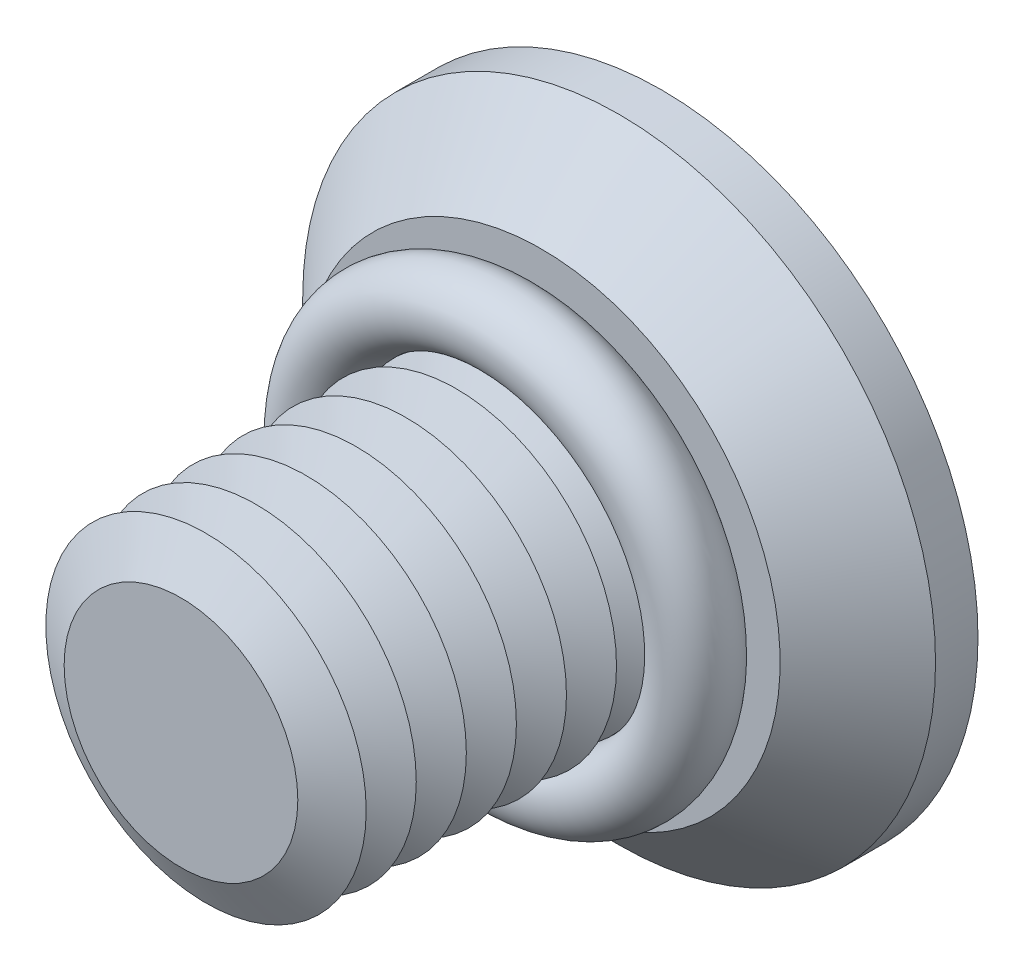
ISO-10303-21;
HEADER;
FILE_DESCRIPTION(('STEP AP214'),'2;1');
FILE_NAME('part.step','',(''),(''),'','','');
FILE_SCHEMA(('AUTOMOTIVE_DESIGN { 1 0 10303 214 1 1 1 1 }'));
ENDSEC;
DATA;
#1=APPLICATION_CONTEXT('core data for automotive mechanical design processes');
#2=APPLICATION_PROTOCOL_DEFINITION('international standard','automotive_design',2000,#1);
#3=PRODUCT_CONTEXT('',#1,'mechanical');
#4=PRODUCT('Part','Part','',(#3));
#5=PRODUCT_RELATED_PRODUCT_CATEGORY('part','',(#4));
#6=PRODUCT_DEFINITION_FORMATION('','',#4);
#7=PRODUCT_DEFINITION_CONTEXT('part definition',#1,'design');
#8=PRODUCT_DEFINITION('design','',#6,#7);
#9=PRODUCT_DEFINITION_SHAPE('','',#8);
#10=(LENGTH_UNIT() NAMED_UNIT(*) SI_UNIT(.MILLI.,.METRE.));
#11=(NAMED_UNIT(*) PLANE_ANGLE_UNIT() SI_UNIT($,.RADIAN.));
#12=(NAMED_UNIT(*) SI_UNIT($,.STERADIAN.) SOLID_ANGLE_UNIT());
#13=UNCERTAINTY_MEASURE_WITH_UNIT(LENGTH_MEASURE(1.E-05),#10,'distance_accuracy_value','');
#14=(GEOMETRIC_REPRESENTATION_CONTEXT(3) GLOBAL_UNCERTAINTY_ASSIGNED_CONTEXT((#13)) GLOBAL_UNIT_ASSIGNED_CONTEXT((#10,
#11,#12)) REPRESENTATION_CONTEXT('',''));
#15=CARTESIAN_POINT('',(0.,0.,0.));
#16=DIRECTION('',(0.,0.,1.));
#17=DIRECTION('',(1.,0.,0.));
#18=AXIS2_PLACEMENT_3D('',#15,#16,#17);
#19=CARTESIAN_POINT('',(0.,0.,3.9));
#20=DIRECTION('',(0.,0.,1.));
#21=DIRECTION('',(1.,0.,0.));
#22=AXIS2_PLACEMENT_3D('',#19,#20,#21);
#23=TOROIDAL_SURFACE('',#22,4.75,0.9);
#24=CARTESIAN_POINT('',(0.,4.75,3.9));
#25=DIRECTION('',(1.,0.,0.));
#26=DIRECTION('',(0.,0.,-1.));
#27=AXIS2_PLACEMENT_3D('',#24,#25,#26);
#28=CIRCLE('',#27,0.9);
#29=CARTESIAN_POINT('',(0.,5.65,3.9));
#30=VERTEX_POINT('',#29);
#31=EDGE_CURVE('P0_E10',#30,#30,#28,.T.);
#32=CARTESIAN_POINT('',(0.,0.,3.9));
#33=DIRECTION('',(0.,0.,1.));
#34=DIRECTION('',(1.,0.,0.));
#35=AXIS2_PLACEMENT_3D('',#32,#33,#34);
#36=CIRCLE('',#35,5.65);
#37=EDGE_CURVE('',#30,#30,#36,.T.);
#38=ORIENTED_EDGE('',*,*,#31,.F.);
#39=ORIENTED_EDGE('',*,*,#31,.T.);
#40=ORIENTED_EDGE('',*,*,#37,.T.);
#41=ORIENTED_EDGE('',*,*,#37,.F.);
#42=EDGE_LOOP('',(#38,#40,#39,#41));
#43=FACE_BOUND('',#42,.T.);
#44=ADVANCED_FACE('P0_F14',(#43),#23,.T.);
#45=CLOSED_SHELL('',(#44));
#46=MANIFOLD_SOLID_BREP('P0_B1',#45);
#47=CARTESIAN_POINT('',(0.,0.,5.75));
#48=DIRECTION('',(0.,0.,-1.));
#49=DIRECTION('',(-1.,0.,0.));
#50=AXIS2_PLACEMENT_3D('',#47,#48,#49);
#51=CONICAL_SURFACE('',#50,2.91746824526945,1.0471975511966);
#52=CARTESIAN_POINT('',(0.,0.,5.125));
#53=DIRECTION('',(0.,0.,1.));
#54=DIRECTION('',(1.,0.,0.));
#55=AXIS2_PLACEMENT_3D('',#52,#53,#54);
#56=CIRCLE('',#55,4.);
#57=CARTESIAN_POINT('',(4.,0.,5.125));
#58=VERTEX_POINT('',#57);
#59=EDGE_CURVE('P1_E324',#58,#58,#56,.T.);
#60=ORIENTED_EDGE('',*,*,#59,.T.);
#61=EDGE_LOOP('',(#60));
#62=FACE_BOUND('',#61,.T.);
#63=CARTESIAN_POINT('',(0.,0.,5.75));
#64=DIRECTION('',(0.,0.,1.));
#65=DIRECTION('',(1.,0.,0.));
#66=AXIS2_PLACEMENT_3D('',#63,#64,#65);
#67=CIRCLE('',#66,2.91746824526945);
#68=CARTESIAN_POINT('',(2.91746824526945,0.,5.75));
#69=VERTEX_POINT('',#68);
#70=EDGE_CURVE('P1_E321',#69,#69,#67,.T.);
#71=ORIENTED_EDGE('',*,*,#70,.F.);
#72=EDGE_LOOP('',(#71));
#73=FACE_BOUND('',#72,.T.);
#74=ADVANCED_FACE('P1_F15',(#62,#73),#51,.T.);
#75=CARTESIAN_POINT('',(0.,0.,6.375));
#76=DIRECTION('',(0.,0.,1.));
#77=DIRECTION('',(1.,0.,0.));
#78=AXIS2_PLACEMENT_3D('',#75,#76,#77);
#79=CONICAL_SURFACE('',#78,4.,1.0471975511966);
#80=ORIENTED_EDGE('',*,*,#70,.T.);
#81=EDGE_LOOP('',(#80));
#82=FACE_BOUND('',#81,.T.);
#83=CARTESIAN_POINT('',(0.,0.,6.375));
#84=DIRECTION('',(0.,0.,1.));
#85=DIRECTION('',(1.,0.,0.));
#86=AXIS2_PLACEMENT_3D('',#83,#84,#85);
#87=CIRCLE('',#86,4.);
#88=CARTESIAN_POINT('',(4.,0.,6.375));
#89=VERTEX_POINT('',#88);
#90=EDGE_CURVE('P1_E318',#89,#89,#87,.T.);
#91=ORIENTED_EDGE('',*,*,#90,.F.);
#92=EDGE_LOOP('',(#91));
#93=FACE_BOUND('',#92,.T.);
#94=ADVANCED_FACE('P1_F245',(#82,#93),#79,.T.);
#95=CARTESIAN_POINT('',(0.,0.,12.));
#96=DIRECTION('',(0.,0.,1.));
#97=DIRECTION('',(1.,0.,0.));
#98=AXIS2_PLACEMENT_3D('',#95,#96,#97);
#99=PLANE('',#98);
#100=CARTESIAN_POINT('',(0.,0.,12.));
#101=DIRECTION('',(0.,0.,1.));
#102=DIRECTION('',(1.,0.,0.));
#103=AXIS2_PLACEMENT_3D('',#100,#101,#102);
#104=CIRCLE('',#103,2.91746824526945);
#105=CARTESIAN_POINT('',(2.91746824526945,0.,12.));
#106=VERTEX_POINT('',#105);
#107=EDGE_CURVE('P1_E131',#106,#106,#104,.T.);
#108=ORIENTED_EDGE('',*,*,#107,.T.);
#109=EDGE_LOOP('',(#108));
#110=FACE_BOUND('',#109,.T.);
#111=ADVANCED_FACE('P1_F251',(#110),#99,.T.);
#112=CARTESIAN_POINT('',(0.,0.,12.));
#113=DIRECTION('',(0.,0.,-1.));
#114=DIRECTION('',(-1.,0.,0.));
#115=AXIS2_PLACEMENT_3D('',#112,#113,#114);
#116=CONICAL_SURFACE('',#115,2.91746824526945,1.0471975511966);
#117=CARTESIAN_POINT('',(0.,0.,11.375));
#118=DIRECTION('',(0.,0.,1.));
#119=DIRECTION('',(1.,0.,0.));
#120=AXIS2_PLACEMENT_3D('',#117,#118,#119);
#121=CIRCLE('',#120,4.);
#122=CARTESIAN_POINT('',(4.,0.,11.375));
#123=VERTEX_POINT('',#122);
#124=EDGE_CURVE('P1_E133',#123,#123,#121,.T.);
#125=ORIENTED_EDGE('',*,*,#124,.T.);
#126=EDGE_LOOP('',(#125));
#127=FACE_BOUND('',#126,.T.);
#128=ORIENTED_EDGE('',*,*,#107,.F.);
#129=EDGE_LOOP('',(#128));
#130=FACE_BOUND('',#129,.T.);
#131=ADVANCED_FACE('P1_F196',(#127,#130),#116,.T.);
#132=CARTESIAN_POINT('',(0.,0.,11.375));
#133=DIRECTION('',(0.,0.,1.));
#134=DIRECTION('',(1.,0.,0.));
#135=AXIS2_PLACEMENT_3D('',#132,#133,#134);
#136=CONICAL_SURFACE('',#135,4.,1.0471975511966);
#137=CARTESIAN_POINT('',(0.,0.,10.75));
#138=DIRECTION('',(0.,0.,1.));
#139=DIRECTION('',(1.,0.,0.));
#140=AXIS2_PLACEMENT_3D('',#137,#138,#139);
#141=CIRCLE('',#140,2.91746824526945);
#142=CARTESIAN_POINT('',(2.91746824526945,0.,10.75));
#143=VERTEX_POINT('',#142);
#144=EDGE_CURVE('P1_E297',#143,#143,#141,.T.);
#145=ORIENTED_EDGE('',*,*,#144,.T.);
#146=EDGE_LOOP('',(#145));
#147=FACE_BOUND('',#146,.T.);
#148=ORIENTED_EDGE('',*,*,#124,.F.);
#149=EDGE_LOOP('',(#148));
#150=FACE_BOUND('',#149,.T.);
#151=ADVANCED_FACE('P1_F284',(#147,#150),#136,.T.);
#152=CARTESIAN_POINT('',(0.,0.,10.75));
#153=DIRECTION('',(0.,0.,-1.));
#154=DIRECTION('',(-1.,0.,0.));
#155=AXIS2_PLACEMENT_3D('',#152,#153,#154);
#156=CONICAL_SURFACE('',#155,2.91746824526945,1.0471975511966);
#157=CARTESIAN_POINT('',(0.,0.,10.125));
#158=DIRECTION('',(0.,0.,1.));
#159=DIRECTION('',(1.,0.,0.));
#160=AXIS2_PLACEMENT_3D('',#157,#158,#159);
#161=CIRCLE('',#160,4.);
#162=CARTESIAN_POINT('',(4.,0.,10.125));
#163=VERTEX_POINT('',#162);
#164=EDGE_CURVE('P1_E294',#163,#163,#161,.T.);
#165=ORIENTED_EDGE('',*,*,#164,.T.);
#166=EDGE_LOOP('',(#165));
#167=FACE_BOUND('',#166,.T.);
#168=ORIENTED_EDGE('',*,*,#144,.F.);
#169=EDGE_LOOP('',(#168));
#170=FACE_BOUND('',#169,.T.);
#171=ADVANCED_FACE('P1_F279',(#167,#170),#156,.T.);
#172=CARTESIAN_POINT('',(0.,0.,10.125));
#173=DIRECTION('',(0.,0.,1.));
#174=DIRECTION('',(1.,0.,0.));
#175=AXIS2_PLACEMENT_3D('',#172,#173,#174);
#176=CONICAL_SURFACE('',#175,4.,1.0471975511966);
#177=CARTESIAN_POINT('',(0.,0.,9.5));
#178=DIRECTION('',(0.,0.,1.));
#179=DIRECTION('',(1.,0.,0.));
#180=AXIS2_PLACEMENT_3D('',#177,#178,#179);
#181=CIRCLE('',#180,2.91746824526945);
#182=CARTESIAN_POINT('',(2.91746824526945,0.,9.5));
#183=VERTEX_POINT('',#182);
#184=EDGE_CURVE('P1_E301',#183,#183,#181,.T.);
#185=ORIENTED_EDGE('',*,*,#184,.T.);
#186=EDGE_LOOP('',(#185));
#187=FACE_BOUND('',#186,.T.);
#188=ORIENTED_EDGE('',*,*,#164,.F.);
#189=EDGE_LOOP('',(#188));
#190=FACE_BOUND('',#189,.T.);
#191=ADVANCED_FACE('P1_F276',(#187,#190),#176,.T.);
#192=CARTESIAN_POINT('',(0.,0.,9.5));
#193=DIRECTION('',(0.,0.,-1.));
#194=DIRECTION('',(-1.,0.,0.));
#195=AXIS2_PLACEMENT_3D('',#192,#193,#194);
#196=CONICAL_SURFACE('',#195,2.91746824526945,1.0471975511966);
#197=CARTESIAN_POINT('',(0.,0.,8.875));
#198=DIRECTION('',(0.,0.,1.));
#199=DIRECTION('',(1.,0.,0.));
#200=AXIS2_PLACEMENT_3D('',#197,#198,#199);
#201=CIRCLE('',#200,4.);
#202=CARTESIAN_POINT('',(4.,0.,8.875));
#203=VERTEX_POINT('',#202);
#204=EDGE_CURVE('P1_E306',#203,#203,#201,.T.);
#205=ORIENTED_EDGE('',*,*,#204,.T.);
#206=EDGE_LOOP('',(#205));
#207=FACE_BOUND('',#206,.T.);
#208=ORIENTED_EDGE('',*,*,#184,.F.);
#209=EDGE_LOOP('',(#208));
#210=FACE_BOUND('',#209,.T.);
#211=ADVANCED_FACE('P1_F271',(#207,#210),#196,.T.);
#212=CARTESIAN_POINT('',(0.,0.,8.875));
#213=DIRECTION('',(0.,0.,1.));
#214=DIRECTION('',(1.,0.,0.));
#215=AXIS2_PLACEMENT_3D('',#212,#213,#214);
#216=CONICAL_SURFACE('',#215,4.,1.0471975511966);
#217=CARTESIAN_POINT('',(0.,0.,8.25));
#218=DIRECTION('',(0.,0.,1.));
#219=DIRECTION('',(1.,0.,0.));
#220=AXIS2_PLACEMENT_3D('',#217,#218,#219);
#221=CIRCLE('',#220,2.91746824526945);
#222=CARTESIAN_POINT('',(2.91746824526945,0.,8.25));
#223=VERTEX_POINT('',#222);
#224=EDGE_CURVE('P1_E309',#223,#223,#221,.T.);
#225=ORIENTED_EDGE('',*,*,#224,.T.);
#226=EDGE_LOOP('',(#225));
#227=FACE_BOUND('',#226,.T.);
#228=ORIENTED_EDGE('',*,*,#204,.F.);
#229=EDGE_LOOP('',(#228));
#230=FACE_BOUND('',#229,.T.);
#231=ADVANCED_FACE('P1_F268',(#227,#230),#216,.T.);
#232=CARTESIAN_POINT('',(0.,0.,8.25));
#233=DIRECTION('',(0.,0.,-1.));
#234=DIRECTION('',(-1.,0.,0.));
#235=AXIS2_PLACEMENT_3D('',#232,#233,#234);
#236=CONICAL_SURFACE('',#235,2.91746824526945,1.0471975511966);
#237=CARTESIAN_POINT('',(0.,0.,7.625));
#238=DIRECTION('',(0.,0.,1.));
#239=DIRECTION('',(1.,0.,0.));
#240=AXIS2_PLACEMENT_3D('',#237,#238,#239);
#241=CIRCLE('',#240,4.);
#242=CARTESIAN_POINT('',(4.,0.,7.625));
#243=VERTEX_POINT('',#242);
#244=EDGE_CURVE('P1_E312',#243,#243,#241,.T.);
#245=ORIENTED_EDGE('',*,*,#244,.T.);
#246=EDGE_LOOP('',(#245));
#247=FACE_BOUND('',#246,.T.);
#248=ORIENTED_EDGE('',*,*,#224,.F.);
#249=EDGE_LOOP('',(#248));
#250=FACE_BOUND('',#249,.T.);
#251=ADVANCED_FACE('P1_F262',(#247,#250),#236,.T.);
#252=CARTESIAN_POINT('',(0.,0.,7.625));
#253=DIRECTION('',(0.,0.,1.));
#254=DIRECTION('',(1.,0.,0.));
#255=AXIS2_PLACEMENT_3D('',#252,#253,#254);
#256=CONICAL_SURFACE('',#255,4.,1.0471975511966);
#257=CARTESIAN_POINT('',(0.,0.,7.));
#258=DIRECTION('',(0.,0.,1.));
#259=DIRECTION('',(1.,0.,0.));
#260=AXIS2_PLACEMENT_3D('',#257,#258,#259);
#261=CIRCLE('',#260,2.91746824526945);
#262=CARTESIAN_POINT('',(2.91746824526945,0.,7.));
#263=VERTEX_POINT('',#262);
#264=EDGE_CURVE('P1_E315',#263,#263,#261,.T.);
#265=ORIENTED_EDGE('',*,*,#264,.T.);
#266=EDGE_LOOP('',(#265));
#267=FACE_BOUND('',#266,.T.);
#268=ORIENTED_EDGE('',*,*,#244,.F.);
#269=EDGE_LOOP('',(#268));
#270=FACE_BOUND('',#269,.T.);
#271=ADVANCED_FACE('P1_F258',(#267,#270),#256,.T.);
#272=CARTESIAN_POINT('',(0.,0.,7.));
#273=DIRECTION('',(0.,0.,-1.));
#274=DIRECTION('',(-1.,0.,0.));
#275=AXIS2_PLACEMENT_3D('',#272,#273,#274);
#276=CONICAL_SURFACE('',#275,2.91746824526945,1.0471975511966);
#277=ORIENTED_EDGE('',*,*,#90,.T.);
#278=EDGE_LOOP('',(#277));
#279=FACE_BOUND('',#278,.T.);
#280=ORIENTED_EDGE('',*,*,#264,.F.);
#281=EDGE_LOOP('',(#280));
#282=FACE_BOUND('',#281,.T.);
#283=ADVANCED_FACE('P1_F261',(#279,#282),#276,.T.);
#284=CARTESIAN_POINT('',(0.,0.,4.5));
#285=DIRECTION('',(0.,0.,-1.));
#286=DIRECTION('',(-1.,0.,0.));
#287=AXIS2_PLACEMENT_3D('',#284,#285,#286);
#288=CONICAL_SURFACE('',#287,2.91746824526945,1.0471975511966);
#289=CARTESIAN_POINT('',(0.,0.,4.5));
#290=DIRECTION('',(0.,0.,1.));
#291=DIRECTION('',(1.,0.,0.));
#292=AXIS2_PLACEMENT_3D('',#289,#290,#291);
#293=CIRCLE('',#292,2.91746824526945);
#294=CARTESIAN_POINT('',(2.91746824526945,0.,4.5));
#295=VERTEX_POINT('',#294);
#296=EDGE_CURVE('P1_E326',#295,#295,#293,.T.);
#297=ORIENTED_EDGE('',*,*,#296,.F.);
#298=EDGE_LOOP('',(#297));
#299=FACE_BOUND('',#298,.T.);
#300=CARTESIAN_POINT('',(0.,0.,3.96160254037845));
#301=DIRECTION('',(0.,0.,-1.));
#302=DIRECTION('',(-1.,0.,0.));
#303=AXIS2_PLACEMENT_3D('',#300,#301,#302);
#304=CIRCLE('',#303,3.85);
#305=CARTESIAN_POINT('',(-3.85,0.,3.96160254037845));
#306=VERTEX_POINT('',#305);
#307=EDGE_CURVE('P1_E19',#306,#306,#304,.F.);
#308=ORIENTED_EDGE('',*,*,#307,.T.);
#309=EDGE_LOOP('',(#308));
#310=FACE_BOUND('',#309,.T.);
#311=ADVANCED_FACE('P1_F266',(#299,#310),#288,.T.);
#312=CARTESIAN_POINT('',(0.,0.,5.125));
#313=DIRECTION('',(0.,0.,1.));
#314=DIRECTION('',(1.,0.,0.));
#315=AXIS2_PLACEMENT_3D('',#312,#313,#314);
#316=CONICAL_SURFACE('',#315,4.,1.0471975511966);
#317=ORIENTED_EDGE('',*,*,#296,.T.);
#318=EDGE_LOOP('',(#317));
#319=FACE_BOUND('',#318,.T.);
#320=ORIENTED_EDGE('',*,*,#59,.F.);
#321=EDGE_LOOP('',(#320));
#322=FACE_BOUND('',#321,.T.);
#323=ADVANCED_FACE('P1_F330',(#319,#322),#316,.T.);
#324=CARTESIAN_POINT('',(0.,0.,3.));
#325=DIRECTION('',(0.,0.,-1.));
#326=DIRECTION('',(-1.,0.,0.));
#327=AXIS2_PLACEMENT_3D('',#324,#325,#326);
#328=CONICAL_SURFACE('',#327,2.5,1.0471975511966);
#329=CARTESIAN_POINT('',(0.,0.,4.44337567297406));
#330=VERTEX_POINT('',#329);
#331=VERTEX_LOOP('',#330);
#332=FACE_BOUND('',#331,.T.);
#333=CARTESIAN_POINT('',(0.,0.,3.));
#334=DIRECTION('',(0.,0.,-1.));
#335=DIRECTION('',(-1.,0.,0.));
#336=AXIS2_PLACEMENT_3D('',#333,#334,#335);
#337=CIRCLE('',#336,2.5);
#338=CARTESIAN_POINT('',(-2.5,0.,3.));
#339=VERTEX_POINT('',#338);
#340=CARTESIAN_POINT('',(-1.25,2.1650635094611,3.));
#341=VERTEX_POINT('',#340);
#342=EDGE_CURVE('P1_E117',#339,#341,#337,.T.);
#343=ORIENTED_EDGE('',*,*,#342,.T.);
#344=CARTESIAN_POINT('',(0.,0.,3.));
#345=DIRECTION('',(0.,0.,-1.));
#346=DIRECTION('',(-1.,0.,0.));
#347=AXIS2_PLACEMENT_3D('',#344,#345,#346);
#348=CIRCLE('',#347,2.5);
#349=CARTESIAN_POINT('',(1.25,2.1650635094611,3.));
#350=VERTEX_POINT('',#349);
#351=EDGE_CURVE('P1_E24',#341,#350,#348,.T.);
#352=ORIENTED_EDGE('',*,*,#351,.T.);
#353=CARTESIAN_POINT('',(2.5,0.,3.));
#354=VERTEX_POINT('',#353);
#355=EDGE_CURVE('P1_E635',#350,#354,#348,.T.);
#356=ORIENTED_EDGE('',*,*,#355,.T.);
#357=CARTESIAN_POINT('',(1.25,-2.1650635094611,3.));
#358=VERTEX_POINT('',#357);
#359=EDGE_CURVE('P1_E628',#354,#358,#348,.T.);
#360=ORIENTED_EDGE('',*,*,#359,.T.);
#361=CARTESIAN_POINT('',(-1.25,-2.1650635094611,3.));
#362=VERTEX_POINT('',#361);
#363=EDGE_CURVE('P1_E182',#358,#362,#348,.T.);
#364=ORIENTED_EDGE('',*,*,#363,.T.);
#365=EDGE_CURVE('P1_E179',#362,#339,#348,.T.);
#366=ORIENTED_EDGE('',*,*,#365,.T.);
#367=EDGE_LOOP('',(#343,#352,#356,#360,#364,#366));
#368=FACE_BOUND('',#367,.T.);
#369=ADVANCED_FACE('P1_F198',(#332,#368),#328,.F.);
#370=CARTESIAN_POINT('',(0.,0.,3.));
#371=DIRECTION('',(0.,0.,-1.));
#372=DIRECTION('',(-1.,0.,0.));
#373=AXIS2_PLACEMENT_3D('',#370,#371,#372);
#374=PLANE('',#373);
#375=ORIENTED_EDGE('',*,*,#363,.F.);
#376=DIRECTION('',(-0.866025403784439,-0.5,0.));
#377=VECTOR('',#376,1.);
#378=CARTESIAN_POINT('',(2.5,-1.44337567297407,3.));
#379=LINE('',#378,#377);
#380=CARTESIAN_POINT('',(0.,-2.88675134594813,3.));
#381=VERTEX_POINT('',#380);
#382=EDGE_CURVE('P1_E644',#358,#381,#379,.T.);
#383=ORIENTED_EDGE('',*,*,#382,.T.);
#384=DIRECTION('',(-0.866025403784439,0.5,0.));
#385=VECTOR('',#384,1.);
#386=CARTESIAN_POINT('',(0.,-2.88675134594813,3.));
#387=LINE('',#386,#385);
#388=EDGE_CURVE('P1_E651',#381,#362,#387,.T.);
#389=ORIENTED_EDGE('',*,*,#388,.T.);
#390=EDGE_LOOP('',(#375,#383,#389));
#391=FACE_BOUND('',#390,.T.);
#392=ADVANCED_FACE('P1_F442',(#391),#374,.T.);
#393=ORIENTED_EDGE('',*,*,#365,.F.);
#394=CARTESIAN_POINT('',(-2.5,-1.44337567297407,3.));
#395=VERTEX_POINT('',#394);
#396=EDGE_CURVE('P1_E654',#362,#395,#387,.T.);
#397=ORIENTED_EDGE('',*,*,#396,.T.);
#398=DIRECTION('',(0.,1.,0.));
#399=VECTOR('',#398,1.);
#400=CARTESIAN_POINT('',(-2.5,-1.44337567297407,3.));
#401=LINE('',#400,#399);
#402=EDGE_CURVE('P1_E123',#395,#339,#401,.T.);
#403=ORIENTED_EDGE('',*,*,#402,.T.);
#404=EDGE_LOOP('',(#393,#397,#403));
#405=FACE_BOUND('',#404,.T.);
#406=ADVANCED_FACE('P1_F231',(#405),#374,.T.);
#407=ORIENTED_EDGE('',*,*,#342,.F.);
#408=CARTESIAN_POINT('',(-2.5,1.44337567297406,3.));
#409=VERTEX_POINT('',#408);
#410=EDGE_CURVE('P1_E656',#339,#409,#401,.T.);
#411=ORIENTED_EDGE('',*,*,#410,.T.);
#412=DIRECTION('',(0.866025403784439,0.5,0.));
#413=VECTOR('',#412,1.);
#414=CARTESIAN_POINT('',(-2.5,1.44337567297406,3.));
#415=LINE('',#414,#413);
#416=EDGE_CURVE('P1_E659',#409,#341,#415,.T.);
#417=ORIENTED_EDGE('',*,*,#416,.T.);
#418=EDGE_LOOP('',(#407,#411,#417));
#419=FACE_BOUND('',#418,.T.);
#420=ADVANCED_FACE('P1_F459',(#419),#374,.T.);
#421=ORIENTED_EDGE('',*,*,#351,.F.);
#422=CARTESIAN_POINT('',(0.,2.88675134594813,3.));
#423=VERTEX_POINT('',#422);
#424=EDGE_CURVE('P1_E658',#341,#423,#415,.T.);
#425=ORIENTED_EDGE('',*,*,#424,.T.);
#426=DIRECTION('',(0.866025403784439,-0.5,0.));
#427=VECTOR('',#426,1.);
#428=CARTESIAN_POINT('',(0.,2.88675134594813,3.));
#429=LINE('',#428,#427);
#430=EDGE_CURVE('P1_E161',#423,#350,#429,.T.);
#431=ORIENTED_EDGE('',*,*,#430,.T.);
#432=EDGE_LOOP('',(#421,#425,#431));
#433=FACE_BOUND('',#432,.T.);
#434=ADVANCED_FACE('P1_F468',(#433),#374,.T.);
#435=ORIENTED_EDGE('',*,*,#355,.F.);
#436=CARTESIAN_POINT('',(2.5,1.44337567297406,3.));
#437=VERTEX_POINT('',#436);
#438=EDGE_CURVE('P1_E643',#350,#437,#429,.T.);
#439=ORIENTED_EDGE('',*,*,#438,.T.);
#440=DIRECTION('',(0.,-1.,0.));
#441=VECTOR('',#440,1.);
#442=CARTESIAN_POINT('',(2.5,1.44337567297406,3.));
#443=LINE('',#442,#441);
#444=EDGE_CURVE('P1_E638',#437,#354,#443,.T.);
#445=ORIENTED_EDGE('',*,*,#444,.T.);
#446=EDGE_LOOP('',(#435,#439,#445));
#447=FACE_BOUND('',#446,.T.);
#448=ADVANCED_FACE('P1_F477',(#447),#374,.T.);
#449=ORIENTED_EDGE('',*,*,#359,.F.);
#450=CARTESIAN_POINT('',(2.5,-1.44337567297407,3.));
#451=VERTEX_POINT('',#450);
#452=EDGE_CURVE('P1_E630',#354,#451,#443,.T.);
#453=ORIENTED_EDGE('',*,*,#452,.T.);
#454=EDGE_CURVE('P1_E125',#451,#358,#379,.T.);
#455=ORIENTED_EDGE('',*,*,#454,.T.);
#456=EDGE_LOOP('',(#449,#453,#455));
#457=FACE_BOUND('',#456,.T.);
#458=ADVANCED_FACE('P1_F229',(#457),#374,.T.);
#459=CARTESIAN_POINT('',(2.5,-1.44337567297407,3.));
#460=DIRECTION('',(0.5,-0.866025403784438,0.));
#461=DIRECTION('',(0.866025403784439,0.5,0.));
#462=AXIS2_PLACEMENT_3D('',#459,#460,#461);
#463=PLANE('',#462);
#464=DIRECTION('',(0.,0.,-1.));
#465=VECTOR('',#464,1.);
#466=CARTESIAN_POINT('',(2.5,-1.44337567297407,3.));
#467=LINE('',#466,#465);
#468=CARTESIAN_POINT('',(2.5,-1.44337567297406,0.));
#469=VERTEX_POINT('',#468);
#470=EDGE_CURVE('P1_E164',#451,#469,#467,.T.);
#471=ORIENTED_EDGE('',*,*,#470,.T.);
#472=CARTESIAN_POINT('',(2.5002,-1.44326020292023,-3.09419640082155E-05));
#473=CARTESIAN_POINT('',(2.3963647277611,-1.50320952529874,0.016040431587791));
#474=CARTESIAN_POINT('',(2.29234116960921,-1.56326755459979,0.0306306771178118));
#475=CARTESIAN_POINT('',(2.08392662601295,-1.68359574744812,0.0562644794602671));
#476=CARTESIAN_POINT('',(1.97953550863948,-1.74386598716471,0.0673065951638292));
#477=CARTESIAN_POINT('',(1.77101887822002,-1.86425311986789,0.0851994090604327));
#478=CARTESIAN_POINT('',(1.66689477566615,-1.9243691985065,0.0920714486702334));
#479=CARTESIAN_POINT('',(1.45851376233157,-2.04467803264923,0.101286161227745));
#480=CARTESIAN_POINT('',(1.35425688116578,-2.10487077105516,0.103629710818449));
#481=CARTESIAN_POINT('',(1.14574311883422,-2.22525624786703,0.103629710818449));
#482=CARTESIAN_POINT('',(1.04148623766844,-2.28544898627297,0.101286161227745));
#483=CARTESIAN_POINT('',(0.833105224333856,-2.4057578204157,0.0920714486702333));
#484=CARTESIAN_POINT('',(0.728981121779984,-2.4658738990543,0.0851994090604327));
#485=CARTESIAN_POINT('',(0.520464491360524,-2.58626103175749,0.0673065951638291));
#486=CARTESIAN_POINT('',(0.416073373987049,-2.64653127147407,0.056264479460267));
#487=CARTESIAN_POINT('',(0.207658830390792,-2.7668594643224,0.0306306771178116));
#488=CARTESIAN_POINT('',(0.103635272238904,-2.82691749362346,0.0160404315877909));
#489=CARTESIAN_POINT('',(-0.000199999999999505,-2.88686681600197,-3.09419640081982E-05));
#490=B_SPLINE_CURVE_WITH_KNOTS('',3,(#472,#473,#474,#475,#476,#477,#478,#479,#480,#481,#482,
#483,#484,#485,#486,#487,#488,#489),.UNSPECIFIED.,.F.,.F.,(4,2,2,2,2,2,2,2,4),(0.,
0.362931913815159,0.726011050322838,1.08721601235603,1.44835104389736,1.80948607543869,
2.17069103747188,2.53377017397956,2.89670208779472),.UNSPECIFIED.);
#491=CARTESIAN_POINT('',(0.,-2.88675134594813,0.));
#492=VERTEX_POINT('',#491);
#493=EDGE_CURVE('P1_E118',#469,#492,#490,.T.);
#494=ORIENTED_EDGE('',*,*,#493,.T.);
#495=DIRECTION('',(0.,0.,-1.));
#496=VECTOR('',#495,1.);
#497=CARTESIAN_POINT('',(0.,-2.88675134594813,3.));
#498=LINE('',#497,#496);
#499=EDGE_CURVE('P1_E116',#381,#492,#498,.T.);
#500=ORIENTED_EDGE('',*,*,#499,.F.);
#501=ORIENTED_EDGE('',*,*,#382,.F.);
#502=ORIENTED_EDGE('',*,*,#454,.F.);
#503=EDGE_LOOP('',(#471,#494,#500,#501,#502));
#504=FACE_BOUND('',#503,.T.);
#505=ADVANCED_FACE('P1_F226',(#504),#463,.F.);
#506=CARTESIAN_POINT('',(0.,-2.88675134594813,3.));
#507=DIRECTION('',(-0.5,-0.866025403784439,0.));
#508=DIRECTION('',(0.866025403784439,-0.5,0.));
#509=AXIS2_PLACEMENT_3D('',#506,#507,#508);
#510=PLANE('',#509);
#511=ORIENTED_EDGE('',*,*,#499,.T.);
#512=CARTESIAN_POINT('',(0.000200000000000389,-2.88686681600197,-3.09419640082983E-05));
#513=CARTESIAN_POINT('',(-0.103635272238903,-2.82691749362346,0.0160404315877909));
#514=CARTESIAN_POINT('',(-0.207658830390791,-2.7668594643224,0.0306306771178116));
#515=CARTESIAN_POINT('',(-0.416073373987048,-2.64653127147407,0.056264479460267));
#516=CARTESIAN_POINT('',(-0.520464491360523,-2.58626103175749,0.0673065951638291));
#517=CARTESIAN_POINT('',(-0.728981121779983,-2.4658738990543,0.0851994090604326));
#518=CARTESIAN_POINT('',(-0.833105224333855,-2.4057578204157,0.0920714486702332));
#519=CARTESIAN_POINT('',(-1.04148623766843,-2.28544898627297,0.101286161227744));
#520=CARTESIAN_POINT('',(-1.14574311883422,-2.22525624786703,0.103629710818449));
#521=CARTESIAN_POINT('',(-1.35425688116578,-2.10487077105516,0.103629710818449));
#522=CARTESIAN_POINT('',(-1.45851376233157,-2.04467803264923,0.101286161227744));
#523=CARTESIAN_POINT('',(-1.66689477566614,-1.9243691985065,0.0920714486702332));
#524=CARTESIAN_POINT('',(-1.77101887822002,-1.8642531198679,0.0851994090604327));
#525=CARTESIAN_POINT('',(-1.97953550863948,-1.74386598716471,0.0673065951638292));
#526=CARTESIAN_POINT('',(-2.08392662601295,-1.68359574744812,0.0562644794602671));
#527=CARTESIAN_POINT('',(-2.29234116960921,-1.56326755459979,0.0306306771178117));
#528=CARTESIAN_POINT('',(-2.3963647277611,-1.50320952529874,0.016040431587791));
#529=CARTESIAN_POINT('',(-2.5002,-1.44326020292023,-3.09419640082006E-05));
#530=B_SPLINE_CURVE_WITH_KNOTS('',3,(#512,#513,#514,#515,#516,#517,#518,#519,#520,#521,#522,
#523,#524,#525,#526,#527,#528,#529),.UNSPECIFIED.,.F.,.F.,(4,2,2,2,2,2,2,2,4),(0.,
0.362931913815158,0.726011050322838,1.08721601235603,1.44835104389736,1.80948607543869,
2.17069103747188,2.53377017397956,2.89670208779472),.UNSPECIFIED.);
#531=CARTESIAN_POINT('',(-2.5,-1.44337567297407,0.));
#532=VERTEX_POINT('',#531);
#533=EDGE_CURVE('P1_E94',#492,#532,#530,.T.);
#534=ORIENTED_EDGE('',*,*,#533,.T.);
#535=DIRECTION('',(0.,0.,-1.));
#536=VECTOR('',#535,1.);
#537=CARTESIAN_POINT('',(-2.5,-1.44337567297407,3.));
#538=LINE('',#537,#536);
#539=EDGE_CURVE('P1_E112',#395,#532,#538,.T.);
#540=ORIENTED_EDGE('',*,*,#539,.F.);
#541=ORIENTED_EDGE('',*,*,#396,.F.);
#542=ORIENTED_EDGE('',*,*,#388,.F.);
#543=EDGE_LOOP('',(#511,#534,#540,#541,#542));
#544=FACE_BOUND('',#543,.T.);
#545=ADVANCED_FACE('P1_F110',(#544),#510,.F.);
#546=CARTESIAN_POINT('',(-2.5,-1.44337567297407,3.));
#547=DIRECTION('',(-1.,0.,0.));
#548=DIRECTION('',(0.,-1.,0.));
#549=AXIS2_PLACEMENT_3D('',#546,#547,#548);
#550=PLANE('',#549);
#551=ORIENTED_EDGE('',*,*,#539,.T.);
#552=CARTESIAN_POINT('',(-2.5,-3.76800948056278,-0.438146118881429));
#553=CARTESIAN_POINT('',(-2.5,-3.65512241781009,-0.412947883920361));
#554=CARTESIAN_POINT('',(-2.5,-3.54216337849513,-0.38806689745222));
#555=CARTESIAN_POINT('',(-2.5,-3.31606595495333,-0.339109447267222));
#556=CARTESIAN_POINT('',(-2.5,-3.202927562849,-0.315033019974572));
#557=CARTESIAN_POINT('',(-2.5,-2.97632910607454,-0.26783262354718));
#558=CARTESIAN_POINT('',(-2.5,-2.86286882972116,-0.244709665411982));
#559=CARTESIAN_POINT('',(-2.5,-2.63570880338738,-0.199678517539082));
#560=CARTESIAN_POINT('',(-2.5,-2.52200905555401,-0.177770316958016));
#561=CARTESIAN_POINT('',(-2.5,-2.18246936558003,-0.114640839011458));
#562=CARTESIAN_POINT('',(-2.5,-1.95621666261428,-0.0755946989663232));
#563=CARTESIAN_POINT('',(-2.5,-1.50233128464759,-0.00642421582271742));
#564=CARTESIAN_POINT('',(-2.5,-1.27469889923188,0.0237019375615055));
#565=CARTESIAN_POINT('',(-2.5,-0.930935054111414,0.0592624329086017));
#566=CARTESIAN_POINT('',(-2.5,-0.815306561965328,0.0695411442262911));
#567=CARTESIAN_POINT('',(-2.5,-0.583775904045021,0.0862573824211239));
#568=CARTESIAN_POINT('',(-2.5,-0.467873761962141,0.0926952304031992));
#569=CARTESIAN_POINT('',(-2.5,-0.235955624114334,0.101355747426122));
#570=CARTESIAN_POINT('',(-2.5,-0.119939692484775,0.103580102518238));
#571=CARTESIAN_POINT('',(-2.5,0.112094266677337,0.103677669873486));
#572=CARTESIAN_POINT('',(-2.5,0.228112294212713,0.101550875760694));
#573=CARTESIAN_POINT('',(-2.5,0.460464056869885,0.0930637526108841));
#574=CARTESIAN_POINT('',(-2.5,0.576797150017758,0.0866861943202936));
#575=CARTESIAN_POINT('',(-2.5,0.809186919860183,0.070053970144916));
#576=CARTESIAN_POINT('',(-2.5,0.925243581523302,0.0597990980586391));
#577=CARTESIAN_POINT('',(-2.5,1.15707831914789,0.0359190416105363));
#578=CARTESIAN_POINT('',(-2.5,1.27285617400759,0.0222917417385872));
#579=CARTESIAN_POINT('',(-2.5,1.50403978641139,-0.0077859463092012));
#580=CARTESIAN_POINT('',(-2.5,1.61944554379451,-0.0242363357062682));
#581=CARTESIAN_POINT('',(-2.5,1.97116037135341,-0.0779484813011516));
#582=CARTESIAN_POINT('',(-2.5,2.20690405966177,-0.118894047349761));
#583=CARTESIAN_POINT('',(-2.5,2.67723558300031,-0.206964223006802));
#584=CARTESIAN_POINT('',(-2.5,2.9118232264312,-0.254089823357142));
#585=CARTESIAN_POINT('',(-2.5,3.38022088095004,-0.352353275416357));
#586=CARTESIAN_POINT('',(-2.5,3.61403064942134,-0.40349227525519));
#587=CARTESIAN_POINT('',(-2.5,4.08105387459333,-0.508428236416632));
#588=CARTESIAN_POINT('',(-2.5,4.31426731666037,-0.562225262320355));
#589=CARTESIAN_POINT('',(-2.5,4.77742011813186,-0.670976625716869));
#590=CARTESIAN_POINT('',(-2.5,5.00736469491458,-0.725908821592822));
#591=CARTESIAN_POINT('',(-2.5,5.46695141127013,-0.837043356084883));
#592=CARTESIAN_POINT('',(-2.5,5.69659354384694,-0.893245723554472));
#593=CARTESIAN_POINT('',(-2.5,6.15532898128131,-1.00649703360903));
#594=CARTESIAN_POINT('',(-2.5,6.38442260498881,-1.06354468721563));
#595=CARTESIAN_POINT('',(-2.5,6.84242442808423,-1.17834514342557));
#596=CARTESIAN_POINT('',(-2.5,7.07133263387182,-1.23609792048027));
#597=CARTESIAN_POINT('',(-2.5,7.30017784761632,-1.29409642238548));
#598=B_SPLINE_CURVE_WITH_KNOTS('',3,(#552,#553,#554,#555,#556,#557,#558,#559,#560,#561,#562,
#563,#564,#565,#566,#567,#568,#569,#570,#571,#572,#573,#574,#575,#576,#577,#578,#579,#580,#581,
#582,#583,#584,#585,#586,#587,#588,#589,#590,#591,#592,#593,#594,#595,#596,#597),.UNSPECIFIED.,
.F.,.F.,(4,2,2,2,2,2,2,2,2,2,2,2,2,2,2,2,2,2,2,2,2,2,4),(0.,0.346996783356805,0.69400925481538,
1.04138068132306,1.38874900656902,2.07743762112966,2.76598637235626,3.11418615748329,
3.46235682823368,3.81038814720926,4.15841997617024,4.50787110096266,4.85734081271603,
5.20703030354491,5.55671994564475,6.27438533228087,6.99216591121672,7.71015258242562,
8.4281567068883,9.13739674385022,9.84665290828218,10.5549206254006,11.2631627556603),.UNSPECIFIED.);
#599=CARTESIAN_POINT('',(-2.5,1.44337567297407,0.));
#600=VERTEX_POINT('',#599);
#601=EDGE_CURVE('P1_E10',#532,#600,#598,.T.);
#602=ORIENTED_EDGE('',*,*,#601,.T.);
#603=DIRECTION('',(0.,0.,-1.));
#604=VECTOR('',#603,1.);
#605=CARTESIAN_POINT('',(-2.5,1.44337567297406,3.));
#606=LINE('',#605,#604);
#607=EDGE_CURVE('P1_E124',#409,#600,#606,.T.);
#608=ORIENTED_EDGE('',*,*,#607,.F.);
#609=ORIENTED_EDGE('',*,*,#410,.F.);
#610=ORIENTED_EDGE('',*,*,#402,.F.);
#611=EDGE_LOOP('',(#551,#602,#608,#609,#610));
#612=FACE_BOUND('',#611,.T.);
#613=ADVANCED_FACE('P1_F120',(#612),#550,.F.);
#614=CARTESIAN_POINT('',(-2.5,1.44337567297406,3.));
#615=DIRECTION('',(-0.5,0.866025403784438,0.));
#616=DIRECTION('',(-0.866025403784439,-0.5,0.));
#617=AXIS2_PLACEMENT_3D('',#614,#615,#616);
#618=PLANE('',#617);
#619=ORIENTED_EDGE('',*,*,#607,.T.);
#620=CARTESIAN_POINT('',(-2.5002,1.44326020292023,-3.09419640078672E-05));
#621=CARTESIAN_POINT('',(-2.3963647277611,1.50320952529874,0.0160404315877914));
#622=CARTESIAN_POINT('',(-2.29234116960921,1.56326755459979,0.0306306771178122));
#623=CARTESIAN_POINT('',(-2.08392662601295,1.68359574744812,0.0562644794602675));
#624=CARTESIAN_POINT('',(-1.97953550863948,1.7438659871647,0.0673065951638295));
#625=CARTESIAN_POINT('',(-1.77101887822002,1.86425311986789,0.0851994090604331));
#626=CARTESIAN_POINT('',(-1.66689477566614,1.9243691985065,0.0920714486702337));
#627=CARTESIAN_POINT('',(-1.45851376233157,2.04467803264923,0.101286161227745));
#628=CARTESIAN_POINT('',(-1.35425688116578,2.10487077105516,0.10362971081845));
#629=CARTESIAN_POINT('',(-1.14574311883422,2.22525624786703,0.10362971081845));
#630=CARTESIAN_POINT('',(-1.04148623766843,2.28544898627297,0.101286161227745));
#631=CARTESIAN_POINT('',(-0.833105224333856,2.40575782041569,0.0920714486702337));
#632=CARTESIAN_POINT('',(-0.728981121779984,2.4658738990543,0.085199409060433));
#633=CARTESIAN_POINT('',(-0.520464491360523,2.58626103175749,0.0673065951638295));
#634=CARTESIAN_POINT('',(-0.416073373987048,2.64653127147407,0.0562644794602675));
#635=CARTESIAN_POINT('',(-0.207658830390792,2.7668594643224,0.0306306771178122));
#636=CARTESIAN_POINT('',(-0.103635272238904,2.82691749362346,0.0160404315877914));
#637=CARTESIAN_POINT('',(0.000199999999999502,2.88686681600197,-3.09419640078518E-05));
#638=B_SPLINE_CURVE_WITH_KNOTS('',3,(#620,#621,#622,#623,#624,#625,#626,#627,#628,#629,#630,
#631,#632,#633,#634,#635,#636,#637),.UNSPECIFIED.,.F.,.F.,(4,2,2,2,2,2,2,2,4),(0.,
0.362931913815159,0.726011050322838,1.08721601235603,1.44835104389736,1.80948607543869,
2.17069103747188,2.53377017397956,2.89670208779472),.UNSPECIFIED.);
#639=CARTESIAN_POINT('',(0.,2.88675134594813,0.));
#640=VERTEX_POINT('',#639);
#641=EDGE_CURVE('P1_E136',#600,#640,#638,.T.);
#642=ORIENTED_EDGE('',*,*,#641,.T.);
#643=DIRECTION('',(0.,0.,-1.));
#644=VECTOR('',#643,1.);
#645=CARTESIAN_POINT('',(0.,2.88675134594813,3.));
#646=LINE('',#645,#644);
#647=EDGE_CURVE('P1_E155',#423,#640,#646,.T.);
#648=ORIENTED_EDGE('',*,*,#647,.F.);
#649=ORIENTED_EDGE('',*,*,#424,.F.);
#650=ORIENTED_EDGE('',*,*,#416,.F.);
#651=EDGE_LOOP('',(#619,#642,#648,#649,#650));
#652=FACE_BOUND('',#651,.T.);
#653=ADVANCED_FACE('P1_F153',(#652),#618,.F.);
#654=CARTESIAN_POINT('',(0.,2.88675134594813,3.));
#655=DIRECTION('',(0.5,0.866025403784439,0.));
#656=DIRECTION('',(-0.866025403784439,0.5,0.));
#657=AXIS2_PLACEMENT_3D('',#654,#655,#656);
#658=PLANE('',#657);
#659=ORIENTED_EDGE('',*,*,#647,.T.);
#660=CARTESIAN_POINT('',(-0.000200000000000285,2.88686681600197,-3.09419640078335E-05));
#661=CARTESIAN_POINT('',(0.103635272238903,2.82691749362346,0.0160404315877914));
#662=CARTESIAN_POINT('',(0.207658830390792,2.7668594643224,0.0306306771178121));
#663=CARTESIAN_POINT('',(0.416073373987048,2.64653127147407,0.0562644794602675));
#664=CARTESIAN_POINT('',(0.520464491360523,2.58626103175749,0.0673065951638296));
#665=CARTESIAN_POINT('',(0.728981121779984,2.4658738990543,0.0851994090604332));
#666=CARTESIAN_POINT('',(0.833105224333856,2.40575782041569,0.0920714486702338));
#667=CARTESIAN_POINT('',(1.04148623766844,2.28544898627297,0.101286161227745));
#668=CARTESIAN_POINT('',(1.14574311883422,2.22525624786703,0.10362971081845));
#669=CARTESIAN_POINT('',(1.35425688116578,2.10487077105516,0.10362971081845));
#670=CARTESIAN_POINT('',(1.45851376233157,2.04467803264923,0.101286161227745));
#671=CARTESIAN_POINT('',(1.66689477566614,1.9243691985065,0.0920714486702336));
#672=CARTESIAN_POINT('',(1.77101887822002,1.86425311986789,0.085199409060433));
#673=CARTESIAN_POINT('',(1.97953550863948,1.7438659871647,0.0673065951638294));
#674=CARTESIAN_POINT('',(2.08392662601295,1.68359574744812,0.0562644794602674));
#675=CARTESIAN_POINT('',(2.29234116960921,1.56326755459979,0.030630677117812));
#676=CARTESIAN_POINT('',(2.3963647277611,1.50320952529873,0.0160404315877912));
#677=CARTESIAN_POINT('',(2.5002,1.44326020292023,-3.09419640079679E-05));
#678=B_SPLINE_CURVE_WITH_KNOTS('',3,(#660,#661,#662,#663,#664,#665,#666,#667,#668,#669,#670,
#671,#672,#673,#674,#675,#676,#677),.UNSPECIFIED.,.F.,.F.,(4,2,2,2,2,2,2,2,4),(0.,
0.362931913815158,0.726011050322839,1.08721601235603,1.44835104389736,1.80948607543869,
2.17069103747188,2.53377017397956,2.89670208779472),.UNSPECIFIED.);
#679=CARTESIAN_POINT('',(2.5,1.44337567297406,0.));
#680=VERTEX_POINT('',#679);
#681=EDGE_CURVE('P1_E141',#640,#680,#678,.T.);
#682=ORIENTED_EDGE('',*,*,#681,.T.);
#683=DIRECTION('',(0.,0.,-1.));
#684=VECTOR('',#683,1.);
#685=CARTESIAN_POINT('',(2.5,1.44337567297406,3.));
#686=LINE('',#685,#684);
#687=EDGE_CURVE('P1_E162',#437,#680,#686,.T.);
#688=ORIENTED_EDGE('',*,*,#687,.F.);
#689=ORIENTED_EDGE('',*,*,#438,.F.);
#690=ORIENTED_EDGE('',*,*,#430,.F.);
#691=EDGE_LOOP('',(#659,#682,#688,#689,#690));
#692=FACE_BOUND('',#691,.T.);
#693=ADVANCED_FACE('P1_F158',(#692),#658,.F.);
#694=CARTESIAN_POINT('',(2.5,1.44337567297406,3.));
#695=DIRECTION('',(1.,0.,0.));
#696=DIRECTION('',(0.,0.,-1.));
#697=AXIS2_PLACEMENT_3D('',#694,#695,#696);
#698=PLANE('',#697);
#699=ORIENTED_EDGE('',*,*,#687,.T.);
#700=CARTESIAN_POINT('',(2.5,-3.76800948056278,-0.438146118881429));
#701=CARTESIAN_POINT('',(2.5,-3.65512241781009,-0.412947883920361));
#702=CARTESIAN_POINT('',(2.5,-3.54216337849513,-0.38806689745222));
#703=CARTESIAN_POINT('',(2.5,-3.31606595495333,-0.339109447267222));
#704=CARTESIAN_POINT('',(2.5,-3.202927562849,-0.315033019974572));
#705=CARTESIAN_POINT('',(2.5,-2.97632910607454,-0.26783262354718));
#706=CARTESIAN_POINT('',(2.5,-2.86286882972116,-0.244709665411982));
#707=CARTESIAN_POINT('',(2.5,-2.63570880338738,-0.199678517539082));
#708=CARTESIAN_POINT('',(2.5,-2.52200905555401,-0.177770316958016));
#709=CARTESIAN_POINT('',(2.5,-2.18246936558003,-0.114640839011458));
#710=CARTESIAN_POINT('',(2.5,-1.95621666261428,-0.0755946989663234));
#711=CARTESIAN_POINT('',(2.5,-1.50233128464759,-0.00642421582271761));
#712=CARTESIAN_POINT('',(2.5,-1.27469889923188,0.0237019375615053));
#713=CARTESIAN_POINT('',(2.5,-0.930935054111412,0.0592624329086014));
#714=CARTESIAN_POINT('',(2.5,-0.815306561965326,0.0695411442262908));
#715=CARTESIAN_POINT('',(2.5,-0.58377590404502,0.0862573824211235));
#716=CARTESIAN_POINT('',(2.5,-0.467873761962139,0.0926952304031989));
#717=CARTESIAN_POINT('',(2.5,-0.235955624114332,0.101355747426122));
#718=CARTESIAN_POINT('',(2.5,-0.119939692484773,0.103580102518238));
#719=CARTESIAN_POINT('',(2.5,0.112094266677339,0.103677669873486));
#720=CARTESIAN_POINT('',(2.5,0.228112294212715,0.101550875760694));
#721=CARTESIAN_POINT('',(2.5,0.460464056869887,0.0930637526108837));
#722=CARTESIAN_POINT('',(2.5,0.57679715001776,0.0866861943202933));
#723=CARTESIAN_POINT('',(2.5,0.809186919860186,0.0700539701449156));
#724=CARTESIAN_POINT('',(2.5,0.925243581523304,0.0597990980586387));
#725=CARTESIAN_POINT('',(2.5,1.1570783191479,0.0359190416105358));
#726=CARTESIAN_POINT('',(2.5,1.27285617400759,0.0222917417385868));
#727=CARTESIAN_POINT('',(2.5,1.50403978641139,-0.00778594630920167));
#728=CARTESIAN_POINT('',(2.5,1.61944554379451,-0.0242363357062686));
#729=CARTESIAN_POINT('',(2.5,1.97116037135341,-0.077948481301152));
#730=CARTESIAN_POINT('',(2.5,2.20690405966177,-0.118894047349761));
#731=CARTESIAN_POINT('',(2.5,2.67723558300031,-0.206964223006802));
#732=CARTESIAN_POINT('',(2.5,2.9118232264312,-0.254089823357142));
#733=CARTESIAN_POINT('',(2.5,3.38022088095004,-0.352353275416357));
#734=CARTESIAN_POINT('',(2.5,3.61403064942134,-0.40349227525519));
#735=CARTESIAN_POINT('',(2.5,4.08105387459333,-0.508428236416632));
#736=CARTESIAN_POINT('',(2.5,4.31426731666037,-0.562225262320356));
#737=CARTESIAN_POINT('',(2.5,4.77742011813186,-0.670976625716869));
#738=CARTESIAN_POINT('',(2.5,5.00736469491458,-0.725908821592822));
#739=CARTESIAN_POINT('',(2.5,5.46695141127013,-0.837043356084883));
#740=CARTESIAN_POINT('',(2.5,5.69659354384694,-0.893245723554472));
#741=CARTESIAN_POINT('',(2.5,6.15532898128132,-1.00649703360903));
#742=CARTESIAN_POINT('',(2.5,6.38442260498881,-1.06354468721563));
#743=CARTESIAN_POINT('',(2.5,6.84242442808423,-1.17834514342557));
#744=CARTESIAN_POINT('',(2.5,7.07133263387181,-1.23609792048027));
#745=CARTESIAN_POINT('',(2.5,7.30017784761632,-1.29409642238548));
#746=B_SPLINE_CURVE_WITH_KNOTS('',3,(#700,#701,#702,#703,#704,#705,#706,#707,#708,#709,#710,
#711,#712,#713,#714,#715,#716,#717,#718,#719,#720,#721,#722,#723,#724,#725,#726,#727,#728,#729,
#730,#731,#732,#733,#734,#735,#736,#737,#738,#739,#740,#741,#742,#743,#744,#745),.UNSPECIFIED.,
.F.,.F.,(4,2,2,2,2,2,2,2,2,2,2,2,2,2,2,2,2,2,2,2,2,2,4),(0.,0.346996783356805,0.69400925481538,
1.04138068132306,1.38874900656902,2.07743762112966,2.76598637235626,3.11418615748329,
3.46235682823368,3.81038814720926,4.15841997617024,4.50787110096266,4.85734081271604,
5.20703030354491,5.55671994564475,6.27438533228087,6.99216591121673,7.71015258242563,
8.4281567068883,9.13739674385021,9.84665290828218,10.5549206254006,11.2631627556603),.UNSPECIFIED.);
#747=EDGE_CURVE('P1_E149',#680,#469,#746,.F.);
#748=ORIENTED_EDGE('',*,*,#747,.T.);
#749=ORIENTED_EDGE('',*,*,#470,.F.);
#750=ORIENTED_EDGE('',*,*,#452,.F.);
#751=ORIENTED_EDGE('',*,*,#444,.F.);
#752=EDGE_LOOP('',(#699,#748,#749,#750,#751));
#753=FACE_BOUND('',#752,.T.);
#754=ADVANCED_FACE('P1_F232',(#753),#698,.F.);
#755=CARTESIAN_POINT('',(0.,0.,0.));
#756=DIRECTION('',(0.,0.,-1.));
#757=DIRECTION('',(-1.,0.,0.));
#758=AXIS2_PLACEMENT_3D('',#755,#756,#757);
#759=CONICAL_SURFACE('',#758,2.88675134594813,1.30899693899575);
#760=CARTESIAN_POINT('',(0.,0.,0.));
#761=DIRECTION('',(0.,0.,-1.));
#762=DIRECTION('',(-1.,0.,0.));
#763=AXIS2_PLACEMENT_3D('',#760,#761,#762);
#764=CIRCLE('',#763,2.88675134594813);
#765=EDGE_CURVE('P1_E30',#469,#492,#764,.T.);
#766=ORIENTED_EDGE('',*,*,#765,.T.);
#767=ORIENTED_EDGE('',*,*,#493,.F.);
#768=EDGE_LOOP('',(#766,#767));
#769=FACE_BOUND('',#768,.T.);
#770=ADVANCED_FACE('P1_F195',(#769),#759,.F.);
#771=EDGE_CURVE('P1_E90',#492,#532,#764,.T.);
#772=ORIENTED_EDGE('',*,*,#771,.T.);
#773=ORIENTED_EDGE('',*,*,#533,.F.);
#774=EDGE_LOOP('',(#772,#773));
#775=FACE_BOUND('',#774,.T.);
#776=ADVANCED_FACE('P1_F92',(#775),#759,.F.);
#777=EDGE_CURVE('P1_E98',#532,#600,#764,.T.);
#778=ORIENTED_EDGE('',*,*,#777,.T.);
#779=ORIENTED_EDGE('',*,*,#601,.F.);
#780=EDGE_LOOP('',(#778,#779));
#781=FACE_BOUND('',#780,.T.);
#782=ADVANCED_FACE('P1_F102',(#781),#759,.F.);
#783=EDGE_CURVE('P1_E130',#600,#640,#764,.T.);
#784=ORIENTED_EDGE('',*,*,#783,.T.);
#785=ORIENTED_EDGE('',*,*,#641,.F.);
#786=EDGE_LOOP('',(#784,#785));
#787=FACE_BOUND('',#786,.T.);
#788=ADVANCED_FACE('P1_F551',(#787),#759,.F.);
#789=EDGE_CURVE('P1_E137',#640,#680,#764,.T.);
#790=ORIENTED_EDGE('',*,*,#789,.T.);
#791=ORIENTED_EDGE('',*,*,#681,.F.);
#792=EDGE_LOOP('',(#790,#791));
#793=FACE_BOUND('',#792,.T.);
#794=ADVANCED_FACE('P1_F144',(#793),#759,.F.);
#795=EDGE_CURVE('P1_E37',#680,#469,#764,.T.);
#796=ORIENTED_EDGE('',*,*,#795,.T.);
#797=ORIENTED_EDGE('',*,*,#747,.F.);
#798=EDGE_LOOP('',(#796,#797));
#799=FACE_BOUND('',#798,.T.);
#800=ADVANCED_FACE('P1_F537',(#799),#759,.F.);
#801=CARTESIAN_POINT('',(0.,0.,0.));
#802=DIRECTION('',(0.,0.,1.));
#803=DIRECTION('',(1.,0.,0.));
#804=AXIS2_PLACEMENT_3D('',#801,#802,#803);
#805=PLANE('',#804);
#806=ORIENTED_EDGE('',*,*,#795,.F.);
#807=ORIENTED_EDGE('',*,*,#789,.F.);
#808=ORIENTED_EDGE('',*,*,#783,.F.);
#809=ORIENTED_EDGE('',*,*,#777,.F.);
#810=ORIENTED_EDGE('',*,*,#771,.F.);
#811=ORIENTED_EDGE('',*,*,#765,.F.);
#812=EDGE_LOOP('',(#806,#807,#808,#809,#810,#811));
#813=FACE_BOUND('',#812,.T.);
#814=CARTESIAN_POINT('',(0.,0.,0.));
#815=DIRECTION('',(0.,0.,-1.));
#816=DIRECTION('',(-1.,0.,0.));
#817=AXIS2_PLACEMENT_3D('',#814,#815,#816);
#818=CIRCLE('',#817,7.9);
#819=CARTESIAN_POINT('',(-7.9,0.,0.));
#820=VERTEX_POINT('',#819);
#821=EDGE_CURVE('P1_E169',#820,#820,#818,.T.);
#822=ORIENTED_EDGE('',*,*,#821,.T.);
#823=EDGE_LOOP('',(#822));
#824=FACE_BOUND('',#823,.T.);
#825=ADVANCED_FACE('P1_F17',(#813,#824),#805,.F.);
#826=CARTESIAN_POINT('',(0.,0.,12.));
#827=DIRECTION('',(0.,0.,-1.));
#828=DIRECTION('',(-1.,0.,0.));
#829=AXIS2_PLACEMENT_3D('',#826,#827,#828);
#830=CYLINDRICAL_SURFACE('',#829,7.9);
#831=ORIENTED_EDGE('',*,*,#821,.F.);
#832=EDGE_LOOP('',(#831));
#833=FACE_BOUND('',#832,.T.);
#834=CARTESIAN_POINT('',(0.,0.,1.06));
#835=DIRECTION('',(0.,0.,-1.));
#836=DIRECTION('',(-1.,0.,0.));
#837=AXIS2_PLACEMENT_3D('',#834,#835,#836);
#838=CIRCLE('',#837,7.9);
#839=CARTESIAN_POINT('',(-7.9,0.,1.06));
#840=VERTEX_POINT('',#839);
#841=EDGE_CURVE('P1_E172',#840,#840,#838,.T.);
#842=ORIENTED_EDGE('',*,*,#841,.T.);
#843=EDGE_LOOP('',(#842));
#844=FACE_BOUND('',#843,.T.);
#845=ADVANCED_FACE('P1_F351',(#833,#844),#830,.T.);
#846=CARTESIAN_POINT('',(0.,0.,0.));
#847=DIRECTION('',(0.,0.,-1.));
#848=DIRECTION('',(-1.,0.,0.));
#849=AXIS2_PLACEMENT_3D('',#846,#847,#848);
#850=CONICAL_SURFACE('',#849,8.96,0.785398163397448);
#851=CARTESIAN_POINT('',(0.,0.,3.));
#852=DIRECTION('',(0.,0.,-1.));
#853=DIRECTION('',(-1.,0.,0.));
#854=AXIS2_PLACEMENT_3D('',#851,#852,#853);
#855=CIRCLE('',#854,5.96);
#856=CARTESIAN_POINT('',(-5.96,0.,3.));
#857=VERTEX_POINT('',#856);
#858=EDGE_CURVE('P1_E176',#857,#857,#855,.T.);
#859=ORIENTED_EDGE('',*,*,#858,.T.);
#860=EDGE_LOOP('',(#859));
#861=FACE_BOUND('',#860,.T.);
#862=ORIENTED_EDGE('',*,*,#841,.F.);
#863=EDGE_LOOP('',(#862));
#864=FACE_BOUND('',#863,.T.);
#865=ADVANCED_FACE('P1_F346',(#861,#864),#850,.T.);
#866=CARTESIAN_POINT('',(0.,3.85,3.));
#867=DIRECTION('',(0.,0.,-1.));
#868=DIRECTION('',(-1.,0.,0.));
#869=AXIS2_PLACEMENT_3D('',#866,#867,#868);
#870=PLANE('',#869);
#871=CARTESIAN_POINT('',(0.,0.,3.));
#872=DIRECTION('',(0.,0.,-1.));
#873=DIRECTION('',(-1.,0.,0.));
#874=AXIS2_PLACEMENT_3D('',#871,#872,#873);
#875=CIRCLE('',#874,3.85);
#876=CARTESIAN_POINT('',(-3.85,0.,3.));
#877=VERTEX_POINT('',#876);
#878=EDGE_CURVE('P1_E173',#877,#877,#875,.T.);
#879=ORIENTED_EDGE('',*,*,#878,.T.);
#880=EDGE_LOOP('',(#879));
#881=FACE_BOUND('',#880,.T.);
#882=ORIENTED_EDGE('',*,*,#858,.F.);
#883=EDGE_LOOP('',(#882));
#884=FACE_BOUND('',#883,.T.);
#885=ADVANCED_FACE('P1_F340',(#881,#884),#870,.F.);
#886=CARTESIAN_POINT('',(0.,0.,0.));
#887=DIRECTION('',(0.,0.,-1.));
#888=DIRECTION('',(-1.,0.,0.));
#889=AXIS2_PLACEMENT_3D('',#886,#887,#888);
#890=CYLINDRICAL_SURFACE('',#889,3.85);
#891=ORIENTED_EDGE('',*,*,#878,.F.);
#892=EDGE_LOOP('',(#891));
#893=FACE_BOUND('',#892,.T.);
#894=ORIENTED_EDGE('',*,*,#307,.F.);
#895=EDGE_LOOP('',(#894));
#896=FACE_BOUND('',#895,.T.);
#897=ADVANCED_FACE('P1_F338',(#893,#896),#890,.T.);
#898=CLOSED_SHELL('',(#74,#94,#111,#131,#151,#171,#191,#211,#231,#251,#271,#283,#311,#323,#369,
#392,#406,#420,#434,#448,#458,#505,#545,#613,#653,#693,#754,#770,#776,#782,#788,#794,#800,#825,
#845,#865,#885,#897));
#899=MANIFOLD_SOLID_BREP('P1_B1',#898);
#900=ADVANCED_BREP_SHAPE_REPRESENTATION('',(#18,#46,#899),#14);
#901=SHAPE_DEFINITION_REPRESENTATION(#9,#900);
ENDSEC;
END-ISO-10303-21;
